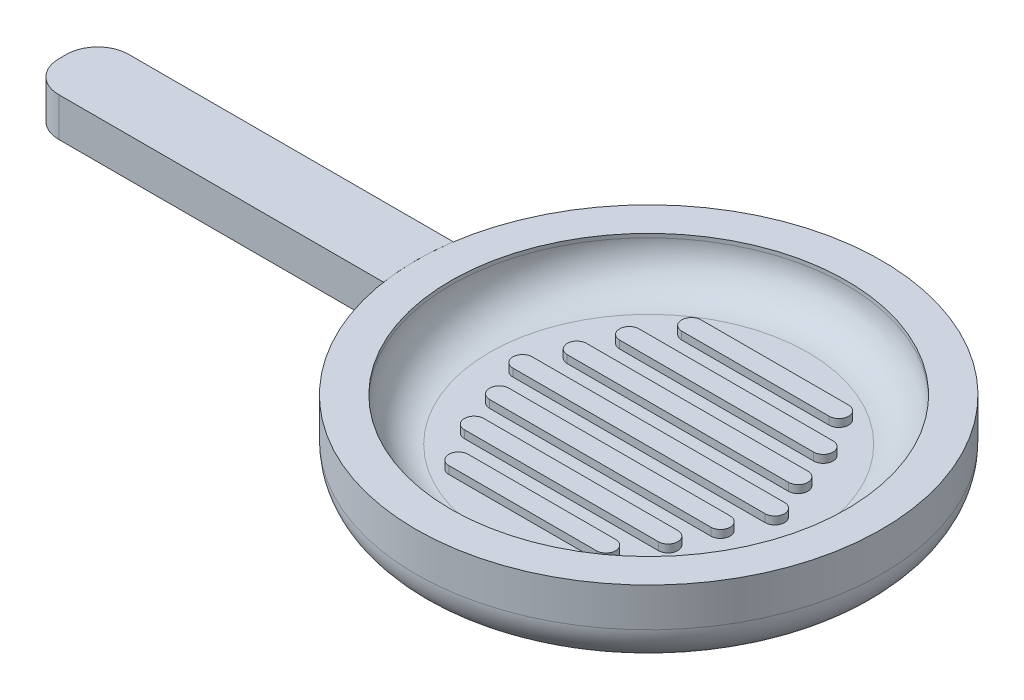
from build123d import *

# Parameters (mm, degrees)
SKETCH1_R           = 60
BOSS_EXTRUDE1_DEPTH = 20
SHELL1_T            = -9
FILLET1_R           = 10
BOSS_EXTRUDE4_DEPTH = 2
BOSS_EXTRUDE5_DEPTH = 10


with BuildPart() as part:
    # Sketch1 → Boss-Extrude1 (new body)
    with BuildSketch(Plane(origin=(0, 0, 0), x_dir=(1, 0, 0), z_dir=(0, 1, 0))):
        with Locations(Location((0, 0, 0), (0, 0, 270))):
            Circle(SKETCH1_R)
    extrude(amount=BOSS_EXTRUDE1_DEPTH)

    # Shell1
    shell1_openings = [part.faces().sort_by_distance(p)[0] for p in [
        (0, 20, 0),
    ]]
    offset(amount=SHELL1_T, openings=shell1_openings, kind=Kind.INTERSECTION)

    # Fillet1
    fillet1_edges = [part.edges().sort_by_distance(p)[0] for p in [
        (0, 0, -60),
        (0, 9, -51),
    ]]
    fillet(fillet1_edges, radius=FILLET1_R)

    # Sketch3 → Boss-Extrude4 (add)
    with BuildSketch(Plane(origin=(0, 9, 0), x_dir=(1, 0, 0), z_dir=(0, 1, 0))):
        with BuildLine():
            Line((-25, 22.5), (25, 22.5))
            ThreePointArc((25, 22.5), (27.5, 20), (25, 17.5))
            Line((25, 17.5), (-25, 17.5))
            ThreePointArc((-25, 17.5), (-27.5, 20), (-25, 22.5))
        make_face()
        with BuildLine():
            Line((-28.5, 12.5), (28.5, 12.5))
            ThreePointArc((28.5, 12.5), (31, 10), (28.5, 7.5))
            Line((28.5, 7.5), (-28.5, 7.5))
            ThreePointArc((-28.5, 7.5), (-31, 10), (-28.5, 12.5))
        make_face()
        with BuildLine():
            Line((-32.5, 2.5), (32.5, 2.5))
            ThreePointArc((32.5, 2.5), (35, 0), (32.5, -2.5))
            Line((32.5, -2.5), (-32.5, -2.5))
            ThreePointArc((-32.5, -2.5), (-35, 0), (-32.5, 2.5))
        make_face()
        with BuildLine():
            Line((-28.5, -12.5), (28.5, -12.5))
            ThreePointArc((28.5, -12.5), (31, -10), (28.5, -7.5))
            Line((28.5, -7.5), (-28.5, -7.5))
            ThreePointArc((-28.5, -7.5), (-31, -10), (-28.5, -12.5))
        make_face()
        with BuildLine():
            Line((-25, -22.5), (25, -22.5))
            ThreePointArc((25, -22.5), (27.5, -20), (25, -17.5))
            Line((25, -17.5), (-25, -17.5))
            ThreePointArc((-25, -17.5), (-27.5, -20), (-25, -22.5))
        make_face()
        with BuildLine():
            Line((-19, 32.5), (19, 32.5))
            ThreePointArc((19, 32.5), (21.5, 30), (19, 27.5))
            Line((19, 27.5), (-19, 27.5))
            ThreePointArc((-19, 27.5), (-21.5, 30), (-19, 32.5))
        make_face()
        with BuildLine():
            Line((-19, -32.5), (19, -32.5))
            ThreePointArc((19, -32.5), (21.5, -30), (19, -27.5))
            Line((19, -27.5), (-19, -27.5))
            ThreePointArc((-19, -27.5), (-21.5, -30), (-19, -32.5))
        make_face()
    extrude(amount=BOSS_EXTRUDE4_DEPTH)


with BuildPart() as body_2:
    # Sketch4 → Boss-Extrude5 (new body)
    with BuildSketch(Plane(origin=(0, 20, 0), x_dir=(1, 0, 0), z_dir=(0, 1, 0))):
        with BuildLine():
            Line((-143, 9), (-59.3211598, 9))
            ThreePointArc((-59.3211598, 9), (-60, 0), (-59.3211598, -9))
            Line((-59.3211598, -9), (-143, -9))
            ThreePointArc((-143, -9), (-148.656854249, -6.656854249), (-151, -1))
            Line((-151, -1), (-151, 1))
            ThreePointArc((-151, 1), (-148.656854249, 6.656854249), (-143, 9))
        make_face()
    extrude(amount=-BOSS_EXTRUDE5_DEPTH)


solid = Compound([part.part, body_2.part])
